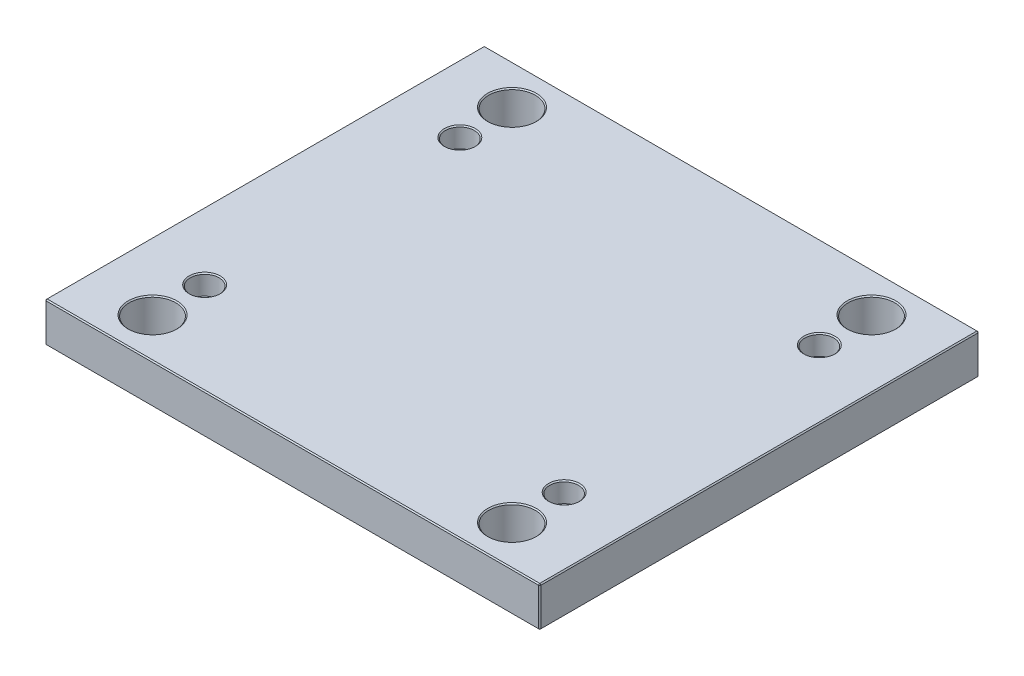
ISO-10303-21;
HEADER;
FILE_DESCRIPTION(('STEP AP214'),'2;1');
FILE_NAME('part.step','',(''),(''),'','','');
FILE_SCHEMA(('AUTOMOTIVE_DESIGN { 1 0 10303 214 1 1 1 1 }'));
ENDSEC;
DATA;
#1=APPLICATION_CONTEXT('core data for automotive mechanical design processes');
#2=APPLICATION_PROTOCOL_DEFINITION('international standard','automotive_design',2000,#1);
#3=PRODUCT_CONTEXT('',#1,'mechanical');
#4=PRODUCT('Part','Part','',(#3));
#5=PRODUCT_RELATED_PRODUCT_CATEGORY('part','',(#4));
#6=PRODUCT_DEFINITION_FORMATION('','',#4);
#7=PRODUCT_DEFINITION_CONTEXT('part definition',#1,'design');
#8=PRODUCT_DEFINITION('design','',#6,#7);
#9=PRODUCT_DEFINITION_SHAPE('','',#8);
#10=(LENGTH_UNIT() NAMED_UNIT(*) SI_UNIT(.MILLI.,.METRE.));
#11=(NAMED_UNIT(*) PLANE_ANGLE_UNIT() SI_UNIT($,.RADIAN.));
#12=(NAMED_UNIT(*) SI_UNIT($,.STERADIAN.) SOLID_ANGLE_UNIT());
#13=UNCERTAINTY_MEASURE_WITH_UNIT(LENGTH_MEASURE(1.E-05),#10,'distance_accuracy_value','');
#14=(GEOMETRIC_REPRESENTATION_CONTEXT(3) GLOBAL_UNCERTAINTY_ASSIGNED_CONTEXT((#13)) GLOBAL_UNIT_ASSIGNED_CONTEXT((#10,
#11,#12)) REPRESENTATION_CONTEXT('',''));
#15=CARTESIAN_POINT('',(0.,0.,0.));
#16=DIRECTION('',(0.,0.,1.));
#17=DIRECTION('',(1.,0.,0.));
#18=AXIS2_PLACEMENT_3D('',#15,#16,#17);
#19=CARTESIAN_POINT('',(-223.,36.,198.));
#20=DIRECTION('',(1.,0.,0.));
#21=DIRECTION('',(0.,0.,-1.));
#22=AXIS2_PLACEMENT_3D('',#19,#20,#21);
#23=PLANE('',#22);
#24=DIRECTION('',(0.,-1.,0.));
#25=VECTOR('',#24,1.);
#26=CARTESIAN_POINT('',(-223.,36.,-197.));
#27=LINE('',#26,#25);
#28=CARTESIAN_POINT('',(-223.,35.,-197.));
#29=VERTEX_POINT('',#28);
#30=CARTESIAN_POINT('',(-223.,1.,-197.));
#31=VERTEX_POINT('',#30);
#32=EDGE_CURVE('E115',#29,#31,#27,.T.);
#33=ORIENTED_EDGE('',*,*,#32,.T.);
#34=DIRECTION('',(0.,0.,1.));
#35=VECTOR('',#34,1.);
#36=CARTESIAN_POINT('',(-223.,1.,198.));
#37=LINE('',#36,#35);
#38=CARTESIAN_POINT('',(-223.,1.,197.));
#39=VERTEX_POINT('',#38);
#40=EDGE_CURVE('E111',#31,#39,#37,.T.);
#41=ORIENTED_EDGE('',*,*,#40,.T.);
#42=DIRECTION('',(0.,1.,0.));
#43=VECTOR('',#42,1.);
#44=CARTESIAN_POINT('',(-223.,36.,197.));
#45=LINE('',#44,#43);
#46=CARTESIAN_POINT('',(-223.,35.,197.));
#47=VERTEX_POINT('',#46);
#48=EDGE_CURVE('E104',#39,#47,#45,.T.);
#49=ORIENTED_EDGE('',*,*,#48,.T.);
#50=DIRECTION('',(0.,0.,-1.));
#51=VECTOR('',#50,1.);
#52=CARTESIAN_POINT('',(-223.,35.,-198.));
#53=LINE('',#52,#51);
#54=EDGE_CURVE('E108',#47,#29,#53,.T.);
#55=ORIENTED_EDGE('',*,*,#54,.T.);
#56=EDGE_LOOP('',(#33,#41,#49,#55));
#57=FACE_BOUND('',#56,.T.);
#58=ADVANCED_FACE('F16',(#57),#23,.F.);
#59=CARTESIAN_POINT('',(223.,36.,198.));
#60=DIRECTION('',(0.,0.,-1.));
#61=DIRECTION('',(-1.,0.,0.));
#62=AXIS2_PLACEMENT_3D('',#59,#60,#61);
#63=PLANE('',#62);
#64=DIRECTION('',(-1.,0.,0.));
#65=VECTOR('',#64,1.);
#66=CARTESIAN_POINT('',(-223.,35.,198.));
#67=LINE('',#66,#65);
#68=CARTESIAN_POINT('',(222.,35.,198.));
#69=VERTEX_POINT('',#68);
#70=CARTESIAN_POINT('',(-222.,35.,198.));
#71=VERTEX_POINT('',#70);
#72=EDGE_CURVE('E170',#69,#71,#67,.T.);
#73=ORIENTED_EDGE('',*,*,#72,.T.);
#74=DIRECTION('',(0.,-1.,0.));
#75=VECTOR('',#74,1.);
#76=CARTESIAN_POINT('',(-222.,36.,198.));
#77=LINE('',#76,#75);
#78=CARTESIAN_POINT('',(-222.,1.00000000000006,198.));
#79=VERTEX_POINT('',#78);
#80=EDGE_CURVE('E123',#71,#79,#77,.T.);
#81=ORIENTED_EDGE('',*,*,#80,.T.);
#82=DIRECTION('',(1.,0.,0.));
#83=VECTOR('',#82,1.);
#84=CARTESIAN_POINT('',(223.,1.00000000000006,198.));
#85=LINE('',#84,#83);
#86=CARTESIAN_POINT('',(222.,1.00000000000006,198.));
#87=VERTEX_POINT('',#86);
#88=EDGE_CURVE('E174',#79,#87,#85,.T.);
#89=ORIENTED_EDGE('',*,*,#88,.T.);
#90=DIRECTION('',(0.,1.,0.));
#91=VECTOR('',#90,1.);
#92=CARTESIAN_POINT('',(222.,36.,198.));
#93=LINE('',#92,#91);
#94=EDGE_CURVE('E172',#87,#69,#93,.T.);
#95=ORIENTED_EDGE('',*,*,#94,.T.);
#96=EDGE_LOOP('',(#73,#81,#89,#95));
#97=FACE_BOUND('',#96,.T.);
#98=ADVANCED_FACE('F413',(#97),#63,.F.);
#99=CARTESIAN_POINT('',(223.,36.,198.));
#100=DIRECTION('',(-1.,0.,0.));
#101=DIRECTION('',(0.,0.,1.));
#102=AXIS2_PLACEMENT_3D('',#99,#100,#101);
#103=PLANE('',#102);
#104=DIRECTION('',(0.,0.,-1.));
#105=VECTOR('',#104,1.);
#106=CARTESIAN_POINT('',(223.,1.00000000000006,198.));
#107=LINE('',#106,#105);
#108=CARTESIAN_POINT('',(223.,1.00000000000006,197.));
#109=VERTEX_POINT('',#108);
#110=CARTESIAN_POINT('',(223.,1.00000000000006,-197.));
#111=VERTEX_POINT('',#110);
#112=EDGE_CURVE('E165',#109,#111,#107,.T.);
#113=ORIENTED_EDGE('',*,*,#112,.T.);
#114=DIRECTION('',(0.,1.,0.));
#115=VECTOR('',#114,1.);
#116=CARTESIAN_POINT('',(223.,36.,-197.));
#117=LINE('',#116,#115);
#118=CARTESIAN_POINT('',(223.,35.,-197.));
#119=VERTEX_POINT('',#118);
#120=EDGE_CURVE('E167',#111,#119,#117,.T.);
#121=ORIENTED_EDGE('',*,*,#120,.T.);
#122=DIRECTION('',(0.,0.,1.));
#123=VECTOR('',#122,1.);
#124=CARTESIAN_POINT('',(223.,35.,198.));
#125=LINE('',#124,#123);
#126=CARTESIAN_POINT('',(223.,35.,197.));
#127=VERTEX_POINT('',#126);
#128=EDGE_CURVE('E161',#119,#127,#125,.T.);
#129=ORIENTED_EDGE('',*,*,#128,.T.);
#130=DIRECTION('',(0.,-1.,0.));
#131=VECTOR('',#130,1.);
#132=CARTESIAN_POINT('',(223.,36.,197.));
#133=LINE('',#132,#131);
#134=EDGE_CURVE('E163',#127,#109,#133,.T.);
#135=ORIENTED_EDGE('',*,*,#134,.T.);
#136=EDGE_LOOP('',(#113,#121,#129,#135));
#137=FACE_BOUND('',#136,.T.);
#138=ADVANCED_FACE('F406',(#137),#103,.F.);
#139=CARTESIAN_POINT('',(223.,36.,-198.));
#140=DIRECTION('',(0.,0.,1.));
#141=DIRECTION('',(1.,0.,0.));
#142=AXIS2_PLACEMENT_3D('',#139,#140,#141);
#143=PLANE('',#142);
#144=DIRECTION('',(0.,-1.,0.));
#145=VECTOR('',#144,1.);
#146=CARTESIAN_POINT('',(222.,36.,-198.));
#147=LINE('',#146,#145);
#148=CARTESIAN_POINT('',(222.,35.,-198.));
#149=VERTEX_POINT('',#148);
#150=CARTESIAN_POINT('',(222.,1.00000000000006,-198.));
#151=VERTEX_POINT('',#150);
#152=EDGE_CURVE('E154',#149,#151,#147,.T.);
#153=ORIENTED_EDGE('',*,*,#152,.T.);
#154=DIRECTION('',(-1.,0.,0.));
#155=VECTOR('',#154,1.);
#156=CARTESIAN_POINT('',(223.,1.00000000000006,-198.));
#157=LINE('',#156,#155);
#158=CARTESIAN_POINT('',(-222.,1.00000000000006,-198.));
#159=VERTEX_POINT('',#158);
#160=EDGE_CURVE('E159',#151,#159,#157,.T.);
#161=ORIENTED_EDGE('',*,*,#160,.T.);
#162=DIRECTION('',(0.,1.,0.));
#163=VECTOR('',#162,1.);
#164=CARTESIAN_POINT('',(-222.,36.,-198.));
#165=LINE('',#164,#163);
#166=CARTESIAN_POINT('',(-222.,35.,-198.));
#167=VERTEX_POINT('',#166);
#168=EDGE_CURVE('E156',#159,#167,#165,.T.);
#169=ORIENTED_EDGE('',*,*,#168,.T.);
#170=DIRECTION('',(1.,0.,0.));
#171=VECTOR('',#170,1.);
#172=CARTESIAN_POINT('',(223.,35.,-198.));
#173=LINE('',#172,#171);
#174=EDGE_CURVE('E152',#167,#149,#173,.T.);
#175=ORIENTED_EDGE('',*,*,#174,.T.);
#176=EDGE_LOOP('',(#153,#161,#169,#175));
#177=FACE_BOUND('',#176,.T.);
#178=ADVANCED_FACE('F431',(#177),#143,.F.);
#179=CARTESIAN_POINT('',(0.,36.,0.));
#180=DIRECTION('',(0.,1.,0.));
#181=DIRECTION('',(0.,0.,1.));
#182=AXIS2_PLACEMENT_3D('',#179,#180,#181);
#183=PLANE('',#182);
#184=CARTESIAN_POINT('',(-162.,36.,162.));
#185=DIRECTION('',(0.,1.,0.));
#186=DIRECTION('',(0.,0.,1.));
#187=AXIS2_PLACEMENT_3D('',#184,#185,#186);
#188=CIRCLE('',#187,22.);
#189=CARTESIAN_POINT('',(-162.,36.,184.));
#190=VERTEX_POINT('',#189);
#191=EDGE_CURVE('E317',#190,#190,#188,.F.);
#192=ORIENTED_EDGE('',*,*,#191,.T.);
#193=EDGE_LOOP('',(#192));
#194=FACE_BOUND('',#193,.T.);
#195=CARTESIAN_POINT('',(162.,36.,162.));
#196=DIRECTION('',(0.,1.,0.));
#197=DIRECTION('',(0.,0.,1.));
#198=AXIS2_PLACEMENT_3D('',#195,#196,#197);
#199=CIRCLE('',#198,22.);
#200=CARTESIAN_POINT('',(162.,36.,184.));
#201=VERTEX_POINT('',#200);
#202=EDGE_CURVE('E314',#201,#201,#199,.F.);
#203=ORIENTED_EDGE('',*,*,#202,.T.);
#204=EDGE_LOOP('',(#203));
#205=FACE_BOUND('',#204,.T.);
#206=CARTESIAN_POINT('',(162.,36.,-162.));
#207=DIRECTION('',(0.,1.,0.));
#208=DIRECTION('',(0.,0.,1.));
#209=AXIS2_PLACEMENT_3D('',#206,#207,#208);
#210=CIRCLE('',#209,22.);
#211=CARTESIAN_POINT('',(162.,36.,-140.));
#212=VERTEX_POINT('',#211);
#213=EDGE_CURVE('E311',#212,#212,#210,.F.);
#214=ORIENTED_EDGE('',*,*,#213,.T.);
#215=EDGE_LOOP('',(#214));
#216=FACE_BOUND('',#215,.T.);
#217=CARTESIAN_POINT('',(-162.,36.,-162.));
#218=DIRECTION('',(0.,1.,0.));
#219=DIRECTION('',(0.,0.,1.));
#220=AXIS2_PLACEMENT_3D('',#217,#218,#219);
#221=CIRCLE('',#220,22.);
#222=CARTESIAN_POINT('',(-162.,36.,-140.));
#223=VERTEX_POINT('',#222);
#224=EDGE_CURVE('E308',#223,#223,#221,.F.);
#225=ORIENTED_EDGE('',*,*,#224,.T.);
#226=EDGE_LOOP('',(#225));
#227=FACE_BOUND('',#226,.T.);
#228=CARTESIAN_POINT('',(-162.,36.,115.));
#229=DIRECTION('',(0.,1.,0.));
#230=DIRECTION('',(0.,0.,1.));
#231=AXIS2_PLACEMENT_3D('',#228,#229,#230);
#232=CIRCLE('',#231,14.);
#233=CARTESIAN_POINT('',(-162.,36.,129.));
#234=VERTEX_POINT('',#233);
#235=EDGE_CURVE('E290',#234,#234,#232,.F.);
#236=ORIENTED_EDGE('',*,*,#235,.T.);
#237=EDGE_LOOP('',(#236));
#238=FACE_BOUND('',#237,.T.);
#239=CARTESIAN_POINT('',(162.,36.,115.));
#240=DIRECTION('',(0.,1.,0.));
#241=DIRECTION('',(0.,0.,1.));
#242=AXIS2_PLACEMENT_3D('',#239,#240,#241);
#243=CIRCLE('',#242,14.);
#244=CARTESIAN_POINT('',(162.,36.,129.));
#245=VERTEX_POINT('',#244);
#246=EDGE_CURVE('E287',#245,#245,#243,.F.);
#247=ORIENTED_EDGE('',*,*,#246,.T.);
#248=EDGE_LOOP('',(#247));
#249=FACE_BOUND('',#248,.T.);
#250=CARTESIAN_POINT('',(162.,36.,-115.));
#251=DIRECTION('',(0.,1.,0.));
#252=DIRECTION('',(0.,0.,1.));
#253=AXIS2_PLACEMENT_3D('',#250,#251,#252);
#254=CIRCLE('',#253,14.);
#255=CARTESIAN_POINT('',(162.,36.,-101.));
#256=VERTEX_POINT('',#255);
#257=EDGE_CURVE('E284',#256,#256,#254,.F.);
#258=ORIENTED_EDGE('',*,*,#257,.T.);
#259=EDGE_LOOP('',(#258));
#260=FACE_BOUND('',#259,.T.);
#261=CARTESIAN_POINT('',(-162.,36.,-115.));
#262=DIRECTION('',(0.,1.,0.));
#263=DIRECTION('',(0.,0.,1.));
#264=AXIS2_PLACEMENT_3D('',#261,#262,#263);
#265=CIRCLE('',#264,14.);
#266=CARTESIAN_POINT('',(-162.,36.,-101.));
#267=VERTEX_POINT('',#266);
#268=EDGE_CURVE('E281',#267,#267,#265,.F.);
#269=ORIENTED_EDGE('',*,*,#268,.T.);
#270=EDGE_LOOP('',(#269));
#271=FACE_BOUND('',#270,.T.);
#272=DIRECTION('',(0.,0.,-1.));
#273=VECTOR('',#272,1.);
#274=CARTESIAN_POINT('',(222.,36.,-198.));
#275=LINE('',#274,#273);
#276=CARTESIAN_POINT('',(222.,36.,197.));
#277=VERTEX_POINT('',#276);
#278=CARTESIAN_POINT('',(222.,36.,-197.));
#279=VERTEX_POINT('',#278);
#280=EDGE_CURVE('E31',#277,#279,#275,.T.);
#281=ORIENTED_EDGE('',*,*,#280,.T.);
#282=DIRECTION('',(-1.,0.,0.));
#283=VECTOR('',#282,1.);
#284=CARTESIAN_POINT('',(-223.,36.,-197.));
#285=LINE('',#284,#283);
#286=CARTESIAN_POINT('',(-222.,36.,-197.));
#287=VERTEX_POINT('',#286);
#288=EDGE_CURVE('E190',#279,#287,#285,.T.);
#289=ORIENTED_EDGE('',*,*,#288,.T.);
#290=DIRECTION('',(0.,0.,1.));
#291=VECTOR('',#290,1.);
#292=CARTESIAN_POINT('',(-222.,36.,198.));
#293=LINE('',#292,#291);
#294=CARTESIAN_POINT('',(-222.,36.,197.));
#295=VERTEX_POINT('',#294);
#296=EDGE_CURVE('E186',#287,#295,#293,.T.);
#297=ORIENTED_EDGE('',*,*,#296,.T.);
#298=DIRECTION('',(1.,0.,0.));
#299=VECTOR('',#298,1.);
#300=CARTESIAN_POINT('',(223.,36.,197.));
#301=LINE('',#300,#299);
#302=EDGE_CURVE('E36',#295,#277,#301,.T.);
#303=ORIENTED_EDGE('',*,*,#302,.T.);
#304=EDGE_LOOP('',(#281,#289,#297,#303));
#305=FACE_BOUND('',#304,.T.);
#306=ADVANCED_FACE('F357',(#194,#205,#216,#227,#238,#249,#260,#271,#305),#183,.T.);
#307=CARTESIAN_POINT('',(0.,0.,0.));
#308=DIRECTION('',(0.,1.,0.));
#309=DIRECTION('',(0.,0.,1.));
#310=AXIS2_PLACEMENT_3D('',#307,#308,#309);
#311=PLANE('',#310);
#312=CARTESIAN_POINT('',(-162.,0.,162.));
#313=DIRECTION('',(0.,1.,0.));
#314=DIRECTION('',(0.,0.,1.));
#315=AXIS2_PLACEMENT_3D('',#312,#313,#314);
#316=CIRCLE('',#315,22.);
#317=CARTESIAN_POINT('',(-162.,0.,184.));
#318=VERTEX_POINT('',#317);
#319=EDGE_CURVE('E329',#318,#318,#316,.T.);
#320=ORIENTED_EDGE('',*,*,#319,.T.);
#321=EDGE_LOOP('',(#320));
#322=FACE_BOUND('',#321,.T.);
#323=CARTESIAN_POINT('',(162.,0.,162.));
#324=DIRECTION('',(0.,1.,0.));
#325=DIRECTION('',(0.,0.,1.));
#326=AXIS2_PLACEMENT_3D('',#323,#324,#325);
#327=CIRCLE('',#326,22.);
#328=CARTESIAN_POINT('',(162.,0.,184.));
#329=VERTEX_POINT('',#328);
#330=EDGE_CURVE('E326',#329,#329,#327,.T.);
#331=ORIENTED_EDGE('',*,*,#330,.T.);
#332=EDGE_LOOP('',(#331));
#333=FACE_BOUND('',#332,.T.);
#334=CARTESIAN_POINT('',(162.,0.,-162.));
#335=DIRECTION('',(0.,1.,0.));
#336=DIRECTION('',(0.,0.,1.));
#337=AXIS2_PLACEMENT_3D('',#334,#335,#336);
#338=CIRCLE('',#337,22.);
#339=CARTESIAN_POINT('',(162.,0.,-140.));
#340=VERTEX_POINT('',#339);
#341=EDGE_CURVE('E323',#340,#340,#338,.T.);
#342=ORIENTED_EDGE('',*,*,#341,.T.);
#343=EDGE_LOOP('',(#342));
#344=FACE_BOUND('',#343,.T.);
#345=CARTESIAN_POINT('',(-162.,0.,-162.));
#346=DIRECTION('',(0.,1.,0.));
#347=DIRECTION('',(0.,0.,1.));
#348=AXIS2_PLACEMENT_3D('',#345,#346,#347);
#349=CIRCLE('',#348,22.);
#350=CARTESIAN_POINT('',(-162.,0.,-140.));
#351=VERTEX_POINT('',#350);
#352=EDGE_CURVE('E320',#351,#351,#349,.T.);
#353=ORIENTED_EDGE('',*,*,#352,.T.);
#354=EDGE_LOOP('',(#353));
#355=FACE_BOUND('',#354,.T.);
#356=CARTESIAN_POINT('',(162.,0.,-115.));
#357=DIRECTION('',(0.,1.,0.));
#358=DIRECTION('',(0.,0.,1.));
#359=AXIS2_PLACEMENT_3D('',#356,#357,#358);
#360=CIRCLE('',#359,10.);
#361=CARTESIAN_POINT('',(162.,0.,-105.));
#362=VERTEX_POINT('',#361);
#363=EDGE_CURVE('E263',#362,#362,#360,.T.);
#364=ORIENTED_EDGE('',*,*,#363,.T.);
#365=EDGE_LOOP('',(#364));
#366=FACE_BOUND('',#365,.T.);
#367=CARTESIAN_POINT('',(162.,0.,115.));
#368=DIRECTION('',(0.,1.,0.));
#369=DIRECTION('',(0.,0.,1.));
#370=AXIS2_PLACEMENT_3D('',#367,#368,#369);
#371=CIRCLE('',#370,10.);
#372=CARTESIAN_POINT('',(162.,0.,125.));
#373=VERTEX_POINT('',#372);
#374=EDGE_CURVE('E260',#373,#373,#371,.T.);
#375=ORIENTED_EDGE('',*,*,#374,.T.);
#376=EDGE_LOOP('',(#375));
#377=FACE_BOUND('',#376,.T.);
#378=CARTESIAN_POINT('',(-162.,0.,115.));
#379=DIRECTION('',(0.,1.,0.));
#380=DIRECTION('',(0.,0.,1.));
#381=AXIS2_PLACEMENT_3D('',#378,#379,#380);
#382=CIRCLE('',#381,10.);
#383=CARTESIAN_POINT('',(-162.,0.,125.));
#384=VERTEX_POINT('',#383);
#385=EDGE_CURVE('E257',#384,#384,#382,.T.);
#386=ORIENTED_EDGE('',*,*,#385,.T.);
#387=EDGE_LOOP('',(#386));
#388=FACE_BOUND('',#387,.T.);
#389=CARTESIAN_POINT('',(-162.,0.,-115.));
#390=DIRECTION('',(0.,1.,0.));
#391=DIRECTION('',(0.,0.,1.));
#392=AXIS2_PLACEMENT_3D('',#389,#390,#391);
#393=CIRCLE('',#392,10.);
#394=CARTESIAN_POINT('',(-162.,0.,-105.));
#395=VERTEX_POINT('',#394);
#396=EDGE_CURVE('E192',#395,#395,#393,.T.);
#397=ORIENTED_EDGE('',*,*,#396,.T.);
#398=EDGE_LOOP('',(#397));
#399=FACE_BOUND('',#398,.T.);
#400=DIRECTION('',(0.,0.,1.));
#401=VECTOR('',#400,1.);
#402=CARTESIAN_POINT('',(222.,0.,0.));
#403=LINE('',#402,#401);
#404=CARTESIAN_POINT('',(222.,0.,-197.));
#405=VERTEX_POINT('',#404);
#406=CARTESIAN_POINT('',(222.,0.,197.));
#407=VERTEX_POINT('',#406);
#408=EDGE_CURVE('E177',#405,#407,#403,.T.);
#409=ORIENTED_EDGE('',*,*,#408,.T.);
#410=DIRECTION('',(-1.,0.,0.));
#411=VECTOR('',#410,1.);
#412=CARTESIAN_POINT('',(0.,0.,197.));
#413=LINE('',#412,#411);
#414=CARTESIAN_POINT('',(-222.,0.,197.));
#415=VERTEX_POINT('',#414);
#416=EDGE_CURVE('E183',#407,#415,#413,.T.);
#417=ORIENTED_EDGE('',*,*,#416,.T.);
#418=DIRECTION('',(0.,0.,-1.));
#419=VECTOR('',#418,1.);
#420=CARTESIAN_POINT('',(-222.,0.,0.));
#421=LINE('',#420,#419);
#422=CARTESIAN_POINT('',(-222.,0.,-197.));
#423=VERTEX_POINT('',#422);
#424=EDGE_CURVE('E181',#415,#423,#421,.T.);
#425=ORIENTED_EDGE('',*,*,#424,.T.);
#426=DIRECTION('',(1.,0.,0.));
#427=VECTOR('',#426,1.);
#428=CARTESIAN_POINT('',(0.,0.,-197.));
#429=LINE('',#428,#427);
#430=EDGE_CURVE('E179',#423,#405,#429,.T.);
#431=ORIENTED_EDGE('',*,*,#430,.T.);
#432=EDGE_LOOP('',(#409,#417,#425,#431));
#433=FACE_BOUND('',#432,.T.);
#434=ADVANCED_FACE('F353',(#322,#333,#344,#355,#366,#377,#388,#399,#433),#311,.F.);
#435=CARTESIAN_POINT('',(223.,36.,197.));
#436=DIRECTION('',(-0.707106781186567,0.,-0.707106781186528));
#437=DIRECTION('',(0.,-1.,0.));
#438=AXIS2_PLACEMENT_3D('',#435,#436,#437);
#439=PLANE('',#438);
#440=DIRECTION('',(-0.707106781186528,0.,0.707106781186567));
#441=VECTOR('',#440,1.);
#442=CARTESIAN_POINT('',(222.,35.,198.));
#443=LINE('',#442,#441);
#444=EDGE_CURVE('E141',#69,#127,#443,.F.);
#445=ORIENTED_EDGE('',*,*,#444,.F.);
#446=ORIENTED_EDGE('',*,*,#94,.F.);
#447=DIRECTION('',(0.707106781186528,0.,-0.707106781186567));
#448=VECTOR('',#447,1.);
#449=CARTESIAN_POINT('',(222.,1.00000000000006,198.));
#450=LINE('',#449,#448);
#451=EDGE_CURVE('E144',#109,#87,#450,.F.);
#452=ORIENTED_EDGE('',*,*,#451,.F.);
#453=ORIENTED_EDGE('',*,*,#134,.F.);
#454=EDGE_LOOP('',(#445,#446,#452,#453));
#455=FACE_BOUND('',#454,.T.);
#456=ADVANCED_FACE('F356',(#455),#439,.F.);
#457=CARTESIAN_POINT('',(222.,35.,198.));
#458=DIRECTION('',(0.577350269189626,0.577350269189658,0.577350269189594));
#459=DIRECTION('',(-0.707106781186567,0.707106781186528,0.));
#460=AXIS2_PLACEMENT_3D('',#457,#458,#459);
#461=PLANE('',#460);
#462=DIRECTION('',(0.,-0.707106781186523,0.707106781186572));
#463=VECTOR('',#462,1.);
#464=CARTESIAN_POINT('',(222.,35.,198.));
#465=LINE('',#464,#463);
#466=EDGE_CURVE('E235',#69,#277,#465,.F.);
#467=ORIENTED_EDGE('',*,*,#466,.F.);
#468=ORIENTED_EDGE('',*,*,#444,.T.);
#469=DIRECTION('',(-0.707106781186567,0.707106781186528,0.));
#470=VECTOR('',#469,1.);
#471=CARTESIAN_POINT('',(222.5,35.5,197.));
#472=LINE('',#471,#470);
#473=EDGE_CURVE('E237',#277,#127,#472,.F.);
#474=ORIENTED_EDGE('',*,*,#473,.F.);
#475=EDGE_LOOP('',(#467,#468,#474));
#476=FACE_BOUND('',#475,.T.);
#477=ADVANCED_FACE('F419',(#476),#461,.T.);
#478=CARTESIAN_POINT('',(222.,1.00000000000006,198.));
#479=DIRECTION('',(0.577350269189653,-0.577350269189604,0.57735026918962));
#480=DIRECTION('',(0.707106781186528,0.,-0.707106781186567));
#481=AXIS2_PLACEMENT_3D('',#478,#479,#480);
#482=PLANE('',#481);
#483=DIRECTION('',(-0.707106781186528,-0.707106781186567,0.));
#484=VECTOR('',#483,1.);
#485=CARTESIAN_POINT('',(222.5,0.500000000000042,197.));
#486=LINE('',#485,#484);
#487=EDGE_CURVE('E229',#109,#407,#486,.T.);
#488=ORIENTED_EDGE('',*,*,#487,.F.);
#489=ORIENTED_EDGE('',*,*,#451,.T.);
#490=DIRECTION('',(0.,0.707106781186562,0.707106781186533));
#491=VECTOR('',#490,1.);
#492=CARTESIAN_POINT('',(222.,1.00000000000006,198.));
#493=LINE('',#492,#491);
#494=EDGE_CURVE('E232',#407,#87,#493,.T.);
#495=ORIENTED_EDGE('',*,*,#494,.F.);
#496=EDGE_LOOP('',(#488,#489,#495));
#497=FACE_BOUND('',#496,.T.);
#498=ADVANCED_FACE('F378',(#497),#482,.T.);
#499=CARTESIAN_POINT('',(222.,36.,0.));
#500=DIRECTION('',(0.707106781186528,0.707106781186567,0.));
#501=DIRECTION('',(0.,0.,1.));
#502=AXIS2_PLACEMENT_3D('',#499,#500,#501);
#503=PLANE('',#502);
#504=ORIENTED_EDGE('',*,*,#473,.T.);
#505=ORIENTED_EDGE('',*,*,#128,.F.);
#506=DIRECTION('',(0.707106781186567,-0.707106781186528,0.));
#507=VECTOR('',#506,1.);
#508=CARTESIAN_POINT('',(223.,35.,-197.));
#509=LINE('',#508,#507);
#510=EDGE_CURVE('E224',#279,#119,#509,.T.);
#511=ORIENTED_EDGE('',*,*,#510,.F.);
#512=ORIENTED_EDGE('',*,*,#280,.F.);
#513=EDGE_LOOP('',(#504,#505,#511,#512));
#514=FACE_BOUND('',#513,.T.);
#515=ADVANCED_FACE('F421',(#514),#503,.T.);
#516=CARTESIAN_POINT('',(0.,36.,197.));
#517=DIRECTION('',(0.,0.707106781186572,0.707106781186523));
#518=DIRECTION('',(-1.,0.,0.));
#519=AXIS2_PLACEMENT_3D('',#516,#517,#518);
#520=PLANE('',#519);
#521=ORIENTED_EDGE('',*,*,#466,.T.);
#522=ORIENTED_EDGE('',*,*,#302,.F.);
#523=DIRECTION('',(0.,0.707106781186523,-0.707106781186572));
#524=VECTOR('',#523,1.);
#525=CARTESIAN_POINT('',(-222.,35.5,197.5));
#526=LINE('',#525,#524);
#527=EDGE_CURVE('E127',#71,#295,#526,.T.);
#528=ORIENTED_EDGE('',*,*,#527,.F.);
#529=ORIENTED_EDGE('',*,*,#72,.F.);
#530=EDGE_LOOP('',(#521,#522,#528,#529));
#531=FACE_BOUND('',#530,.T.);
#532=ADVANCED_FACE('F416',(#531),#520,.T.);
#533=CARTESIAN_POINT('',(-222.,36.,198.));
#534=DIRECTION('',(0.707106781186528,0.,-0.707106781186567));
#535=DIRECTION('',(0.,-1.,0.));
#536=AXIS2_PLACEMENT_3D('',#533,#534,#535);
#537=PLANE('',#536);
#538=DIRECTION('',(0.707106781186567,0.,0.707106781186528));
#539=VECTOR('',#538,1.);
#540=CARTESIAN_POINT('',(-222.,1.00000000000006,198.));
#541=LINE('',#540,#539);
#542=EDGE_CURVE('E128',#79,#39,#541,.F.);
#543=ORIENTED_EDGE('',*,*,#542,.F.);
#544=ORIENTED_EDGE('',*,*,#80,.F.);
#545=DIRECTION('',(-0.707106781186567,0.,-0.707106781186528));
#546=VECTOR('',#545,1.);
#547=CARTESIAN_POINT('',(-223.,35.,197.));
#548=LINE('',#547,#546);
#549=EDGE_CURVE('E119',#47,#71,#548,.F.);
#550=ORIENTED_EDGE('',*,*,#549,.F.);
#551=ORIENTED_EDGE('',*,*,#48,.F.);
#552=EDGE_LOOP('',(#543,#544,#550,#551));
#553=FACE_BOUND('',#552,.T.);
#554=ADVANCED_FACE('F121',(#553),#537,.F.);
#555=CARTESIAN_POINT('',(223.,1.00000000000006,198.));
#556=DIRECTION('',(0.,0.707106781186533,-0.707106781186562));
#557=DIRECTION('',(1.,0.,0.));
#558=AXIS2_PLACEMENT_3D('',#555,#556,#557);
#559=PLANE('',#558);
#560=ORIENTED_EDGE('',*,*,#494,.T.);
#561=ORIENTED_EDGE('',*,*,#88,.F.);
#562=DIRECTION('',(0.,-0.707106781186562,-0.707106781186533));
#563=VECTOR('',#562,1.);
#564=CARTESIAN_POINT('',(-222.,1.00000000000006,198.));
#565=LINE('',#564,#563);
#566=EDGE_CURVE('E220',#415,#79,#565,.F.);
#567=ORIENTED_EDGE('',*,*,#566,.F.);
#568=ORIENTED_EDGE('',*,*,#416,.F.);
#569=EDGE_LOOP('',(#560,#561,#567,#568));
#570=FACE_BOUND('',#569,.T.);
#571=ADVANCED_FACE('F383',(#570),#559,.F.);
#572=CARTESIAN_POINT('',(223.,1.00000000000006,198.));
#573=DIRECTION('',(-0.707106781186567,0.707106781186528,0.));
#574=DIRECTION('',(0.,0.,-1.));
#575=AXIS2_PLACEMENT_3D('',#572,#573,#574);
#576=PLANE('',#575);
#577=ORIENTED_EDGE('',*,*,#487,.T.);
#578=ORIENTED_EDGE('',*,*,#408,.F.);
#579=DIRECTION('',(0.707106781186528,0.707106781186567,0.));
#580=VECTOR('',#579,1.);
#581=CARTESIAN_POINT('',(222.5,0.500000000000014,-197.));
#582=LINE('',#581,#580);
#583=EDGE_CURVE('E217',#111,#405,#582,.F.);
#584=ORIENTED_EDGE('',*,*,#583,.F.);
#585=ORIENTED_EDGE('',*,*,#112,.F.);
#586=EDGE_LOOP('',(#577,#578,#584,#585));
#587=FACE_BOUND('',#586,.T.);
#588=ADVANCED_FACE('F376',(#587),#576,.F.);
#589=CARTESIAN_POINT('',(222.,36.,-198.));
#590=DIRECTION('',(-0.707106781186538,0.,0.707106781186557));
#591=DIRECTION('',(0.,-1.,0.));
#592=AXIS2_PLACEMENT_3D('',#589,#590,#591);
#593=PLANE('',#592);
#594=DIRECTION('',(0.707106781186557,0.,0.707106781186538));
#595=VECTOR('',#594,1.);
#596=CARTESIAN_POINT('',(223.,35.,-197.));
#597=LINE('',#596,#595);
#598=EDGE_CURVE('E226',#119,#149,#597,.F.);
#599=ORIENTED_EDGE('',*,*,#598,.F.);
#600=ORIENTED_EDGE('',*,*,#120,.F.);
#601=DIRECTION('',(-0.707106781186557,0.,-0.707106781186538));
#602=VECTOR('',#601,1.);
#603=CARTESIAN_POINT('',(222.,1.00000000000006,-198.));
#604=LINE('',#603,#602);
#605=EDGE_CURVE('E214',#151,#111,#604,.F.);
#606=ORIENTED_EDGE('',*,*,#605,.F.);
#607=ORIENTED_EDGE('',*,*,#152,.F.);
#608=EDGE_LOOP('',(#599,#600,#606,#607));
#609=FACE_BOUND('',#608,.T.);
#610=ADVANCED_FACE('F403',(#609),#593,.F.);
#611=CARTESIAN_POINT('',(223.,35.,-197.));
#612=DIRECTION('',(0.577350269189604,0.577350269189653,-0.57735026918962));
#613=DIRECTION('',(0.,0.707106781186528,0.707106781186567));
#614=AXIS2_PLACEMENT_3D('',#611,#612,#613);
#615=PLANE('',#614);
#616=ORIENTED_EDGE('',*,*,#510,.T.);
#617=ORIENTED_EDGE('',*,*,#598,.T.);
#618=DIRECTION('',(0.,0.707106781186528,0.707106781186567));
#619=VECTOR('',#618,1.);
#620=CARTESIAN_POINT('',(222.,35.5,-197.5));
#621=LINE('',#620,#619);
#622=EDGE_CURVE('E135',#279,#149,#621,.F.);
#623=ORIENTED_EDGE('',*,*,#622,.F.);
#624=EDGE_LOOP('',(#616,#617,#623));
#625=FACE_BOUND('',#624,.T.);
#626=ADVANCED_FACE('F425',(#625),#615,.T.);
#627=CARTESIAN_POINT('',(-223.,35.,197.));
#628=DIRECTION('',(-0.577350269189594,0.577350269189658,0.577350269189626));
#629=DIRECTION('',(0.,-0.707106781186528,0.707106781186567));
#630=AXIS2_PLACEMENT_3D('',#627,#628,#629);
#631=PLANE('',#630);
#632=ORIENTED_EDGE('',*,*,#549,.T.);
#633=ORIENTED_EDGE('',*,*,#527,.T.);
#634=DIRECTION('',(-0.707106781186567,-0.707106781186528,0.));
#635=VECTOR('',#634,1.);
#636=CARTESIAN_POINT('',(-223.,35.,197.));
#637=LINE('',#636,#635);
#638=EDGE_CURVE('E131',#47,#295,#637,.F.);
#639=ORIENTED_EDGE('',*,*,#638,.F.);
#640=EDGE_LOOP('',(#632,#633,#639));
#641=FACE_BOUND('',#640,.T.);
#642=ADVANCED_FACE('F132',(#641),#631,.T.);
#643=CARTESIAN_POINT('',(-222.,1.00000000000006,198.));
#644=DIRECTION('',(-0.577350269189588,-0.577350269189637,0.577350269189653));
#645=DIRECTION('',(0.,-0.707106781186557,-0.707106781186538));
#646=AXIS2_PLACEMENT_3D('',#643,#644,#645);
#647=PLANE('',#646);
#648=ORIENTED_EDGE('',*,*,#566,.T.);
#649=ORIENTED_EDGE('',*,*,#542,.T.);
#650=DIRECTION('',(-0.707106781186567,0.707106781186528,0.));
#651=VECTOR('',#650,1.);
#652=CARTESIAN_POINT('',(-222.5,0.500000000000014,197.));
#653=LINE('',#652,#651);
#654=EDGE_CURVE('E136',#415,#39,#653,.T.);
#655=ORIENTED_EDGE('',*,*,#654,.F.);
#656=EDGE_LOOP('',(#648,#649,#655));
#657=FACE_BOUND('',#656,.T.);
#658=ADVANCED_FACE('F386',(#657),#647,.T.);
#659=CARTESIAN_POINT('',(222.,1.00000000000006,-198.));
#660=DIRECTION('',(0.577350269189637,-0.577350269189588,-0.577350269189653));
#661=DIRECTION('',(-0.707106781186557,0.,-0.707106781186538));
#662=AXIS2_PLACEMENT_3D('',#659,#660,#661);
#663=PLANE('',#662);
#664=ORIENTED_EDGE('',*,*,#605,.T.);
#665=ORIENTED_EDGE('',*,*,#583,.T.);
#666=DIRECTION('',(0.,-0.707106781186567,0.707106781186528));
#667=VECTOR('',#666,1.);
#668=CARTESIAN_POINT('',(222.,1.00000000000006,-198.));
#669=LINE('',#668,#667);
#670=EDGE_CURVE('E207',#151,#405,#669,.T.);
#671=ORIENTED_EDGE('',*,*,#670,.F.);
#672=EDGE_LOOP('',(#664,#665,#671));
#673=FACE_BOUND('',#672,.T.);
#674=ADVANCED_FACE('F397',(#673),#663,.T.);
#675=CARTESIAN_POINT('',(0.,36.,-197.));
#676=DIRECTION('',(0.,0.707106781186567,-0.707106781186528));
#677=DIRECTION('',(1.,0.,0.));
#678=AXIS2_PLACEMENT_3D('',#675,#676,#677);
#679=PLANE('',#678);
#680=ORIENTED_EDGE('',*,*,#622,.T.);
#681=ORIENTED_EDGE('',*,*,#174,.F.);
#682=DIRECTION('',(0.,-0.707106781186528,-0.707106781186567));
#683=VECTOR('',#682,1.);
#684=CARTESIAN_POINT('',(-222.,35.,-198.));
#685=LINE('',#684,#683);
#686=EDGE_CURVE('E204',#287,#167,#685,.T.);
#687=ORIENTED_EDGE('',*,*,#686,.F.);
#688=ORIENTED_EDGE('',*,*,#288,.F.);
#689=EDGE_LOOP('',(#680,#681,#687,#688));
#690=FACE_BOUND('',#689,.T.);
#691=ADVANCED_FACE('F429',(#690),#679,.T.);
#692=CARTESIAN_POINT('',(-222.,36.,0.));
#693=DIRECTION('',(-0.707106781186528,0.707106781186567,0.));
#694=DIRECTION('',(0.,0.,-1.));
#695=AXIS2_PLACEMENT_3D('',#692,#693,#694);
#696=PLANE('',#695);
#697=ORIENTED_EDGE('',*,*,#638,.T.);
#698=ORIENTED_EDGE('',*,*,#296,.F.);
#699=DIRECTION('',(0.707106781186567,0.707106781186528,0.));
#700=VECTOR('',#699,1.);
#701=CARTESIAN_POINT('',(-222.5,35.5,-197.));
#702=LINE('',#701,#700);
#703=EDGE_CURVE('E139',#29,#287,#702,.T.);
#704=ORIENTED_EDGE('',*,*,#703,.F.);
#705=ORIENTED_EDGE('',*,*,#54,.F.);
#706=EDGE_LOOP('',(#697,#698,#704,#705));
#707=FACE_BOUND('',#706,.T.);
#708=ADVANCED_FACE('F138',(#707),#696,.T.);
#709=CARTESIAN_POINT('',(-223.,1.,198.));
#710=DIRECTION('',(0.707106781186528,0.707106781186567,0.));
#711=DIRECTION('',(0.,0.,1.));
#712=AXIS2_PLACEMENT_3D('',#709,#710,#711);
#713=PLANE('',#712);
#714=ORIENTED_EDGE('',*,*,#654,.T.);
#715=ORIENTED_EDGE('',*,*,#40,.F.);
#716=DIRECTION('',(0.707106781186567,-0.707106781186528,0.));
#717=VECTOR('',#716,1.);
#718=CARTESIAN_POINT('',(-223.,1.,-197.));
#719=LINE('',#718,#717);
#720=EDGE_CURVE('E200',#423,#31,#719,.F.);
#721=ORIENTED_EDGE('',*,*,#720,.F.);
#722=ORIENTED_EDGE('',*,*,#424,.F.);
#723=EDGE_LOOP('',(#714,#715,#721,#722));
#724=FACE_BOUND('',#723,.T.);
#725=ADVANCED_FACE('F388',(#724),#713,.F.);
#726=CARTESIAN_POINT('',(223.,1.00000000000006,-198.));
#727=DIRECTION('',(0.,0.707106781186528,0.707106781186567));
#728=DIRECTION('',(-1.,0.,0.));
#729=AXIS2_PLACEMENT_3D('',#726,#727,#728);
#730=PLANE('',#729);
#731=ORIENTED_EDGE('',*,*,#670,.T.);
#732=ORIENTED_EDGE('',*,*,#430,.F.);
#733=DIRECTION('',(0.,0.707106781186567,-0.707106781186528));
#734=VECTOR('',#733,1.);
#735=CARTESIAN_POINT('',(-222.,0.500000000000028,-197.5));
#736=LINE('',#735,#734);
#737=EDGE_CURVE('E197',#159,#423,#736,.F.);
#738=ORIENTED_EDGE('',*,*,#737,.F.);
#739=ORIENTED_EDGE('',*,*,#160,.F.);
#740=EDGE_LOOP('',(#731,#732,#738,#739));
#741=FACE_BOUND('',#740,.T.);
#742=ADVANCED_FACE('F392',(#741),#730,.F.);
#743=CARTESIAN_POINT('',(-222.,35.,-198.));
#744=DIRECTION('',(-0.577350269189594,0.577350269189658,-0.577350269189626));
#745=DIRECTION('',(0.,0.707106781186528,0.707106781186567));
#746=AXIS2_PLACEMENT_3D('',#743,#744,#745);
#747=PLANE('',#746);
#748=ORIENTED_EDGE('',*,*,#703,.T.);
#749=ORIENTED_EDGE('',*,*,#686,.T.);
#750=DIRECTION('',(0.707106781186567,0.,-0.707106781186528));
#751=VECTOR('',#750,1.);
#752=CARTESIAN_POINT('',(-222.,35.,-198.));
#753=LINE('',#752,#751);
#754=EDGE_CURVE('E195',#29,#167,#753,.T.);
#755=ORIENTED_EDGE('',*,*,#754,.F.);
#756=EDGE_LOOP('',(#748,#749,#755));
#757=FACE_BOUND('',#756,.T.);
#758=ADVANCED_FACE('F460',(#757),#747,.T.);
#759=CARTESIAN_POINT('',(-223.,1.,-197.));
#760=DIRECTION('',(-0.577350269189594,-0.577350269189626,-0.577350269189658));
#761=DIRECTION('',(0.,0.707106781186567,-0.707106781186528));
#762=AXIS2_PLACEMENT_3D('',#759,#760,#761);
#763=PLANE('',#762);
#764=ORIENTED_EDGE('',*,*,#737,.T.);
#765=ORIENTED_EDGE('',*,*,#720,.T.);
#766=DIRECTION('',(-0.707106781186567,0.,0.707106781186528));
#767=VECTOR('',#766,1.);
#768=CARTESIAN_POINT('',(-223.,1.,-197.));
#769=LINE('',#768,#767);
#770=EDGE_CURVE('E193',#159,#31,#769,.T.);
#771=ORIENTED_EDGE('',*,*,#770,.F.);
#772=EDGE_LOOP('',(#764,#765,#771));
#773=FACE_BOUND('',#772,.T.);
#774=ADVANCED_FACE('F456',(#773),#763,.T.);
#775=CARTESIAN_POINT('',(-223.,36.,-197.));
#776=DIRECTION('',(0.707106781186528,0.,0.707106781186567));
#777=DIRECTION('',(0.,-1.,0.));
#778=AXIS2_PLACEMENT_3D('',#775,#776,#777);
#779=PLANE('',#778);
#780=ORIENTED_EDGE('',*,*,#754,.T.);
#781=ORIENTED_EDGE('',*,*,#168,.F.);
#782=ORIENTED_EDGE('',*,*,#770,.T.);
#783=ORIENTED_EDGE('',*,*,#32,.F.);
#784=EDGE_LOOP('',(#780,#781,#782,#783));
#785=FACE_BOUND('',#784,.T.);
#786=ADVANCED_FACE('F452',(#785),#779,.F.);
#787=CARTESIAN_POINT('',(-162.,18.,-115.));
#788=DIRECTION('',(0.,1.,0.));
#789=DIRECTION('',(0.,0.,1.));
#790=AXIS2_PLACEMENT_3D('',#787,#788,#789);
#791=CYLINDRICAL_SURFACE('',#790,13.);
#792=CARTESIAN_POINT('',(-162.,35.,-115.));
#793=DIRECTION('',(0.,1.,0.));
#794=DIRECTION('',(0.,0.,1.));
#795=AXIS2_PLACEMENT_3D('',#792,#793,#794);
#796=CIRCLE('',#795,13.);
#797=CARTESIAN_POINT('',(-162.,35.,-102.));
#798=VERTEX_POINT('',#797);
#799=EDGE_CURVE('E299',#798,#798,#796,.T.);
#800=ORIENTED_EDGE('',*,*,#799,.T.);
#801=EDGE_LOOP('',(#800));
#802=FACE_BOUND('',#801,.T.);
#803=CARTESIAN_POINT('',(-162.,18.,-115.));
#804=DIRECTION('',(0.,1.,0.));
#805=DIRECTION('',(0.,0.,1.));
#806=AXIS2_PLACEMENT_3D('',#803,#804,#805);
#807=CIRCLE('',#806,13.);
#808=CARTESIAN_POINT('',(-162.,18.,-102.));
#809=VERTEX_POINT('',#808);
#810=EDGE_CURVE('E147',#809,#809,#807,.T.);
#811=ORIENTED_EDGE('',*,*,#810,.F.);
#812=EDGE_LOOP('',(#811));
#813=FACE_BOUND('',#812,.T.);
#814=ADVANCED_FACE('F455',(#802,#813),#791,.F.);
#815=CARTESIAN_POINT('',(-162.,18.,-115.));
#816=DIRECTION('',(0.,1.,0.));
#817=DIRECTION('',(0.,0.,1.));
#818=AXIS2_PLACEMENT_3D('',#815,#816,#817);
#819=PLANE('',#818);
#820=CARTESIAN_POINT('',(-162.,18.,-115.));
#821=DIRECTION('',(0.,1.,0.));
#822=DIRECTION('',(0.,0.,1.));
#823=AXIS2_PLACEMENT_3D('',#820,#821,#822);
#824=CIRCLE('',#823,9.);
#825=CARTESIAN_POINT('',(-162.,18.,-106.));
#826=VERTEX_POINT('',#825);
#827=EDGE_CURVE('E251',#826,#826,#824,.T.);
#828=ORIENTED_EDGE('',*,*,#827,.F.);
#829=EDGE_LOOP('',(#828));
#830=FACE_BOUND('',#829,.T.);
#831=ORIENTED_EDGE('',*,*,#810,.T.);
#832=EDGE_LOOP('',(#831));
#833=FACE_BOUND('',#832,.T.);
#834=ADVANCED_FACE('F602',(#830,#833),#819,.T.);
#835=CARTESIAN_POINT('',(162.,18.,-115.));
#836=DIRECTION('',(0.,1.,0.));
#837=DIRECTION('',(0.,0.,1.));
#838=AXIS2_PLACEMENT_3D('',#835,#836,#837);
#839=CYLINDRICAL_SURFACE('',#838,13.);
#840=CARTESIAN_POINT('',(162.,35.,-115.));
#841=DIRECTION('',(0.,1.,0.));
#842=DIRECTION('',(0.,0.,1.));
#843=AXIS2_PLACEMENT_3D('',#840,#841,#842);
#844=CIRCLE('',#843,13.);
#845=CARTESIAN_POINT('',(162.,35.,-102.));
#846=VERTEX_POINT('',#845);
#847=EDGE_CURVE('E296',#846,#846,#844,.T.);
#848=ORIENTED_EDGE('',*,*,#847,.T.);
#849=EDGE_LOOP('',(#848));
#850=FACE_BOUND('',#849,.T.);
#851=CARTESIAN_POINT('',(162.,18.,-115.));
#852=DIRECTION('',(0.,1.,0.));
#853=DIRECTION('',(0.,0.,1.));
#854=AXIS2_PLACEMENT_3D('',#851,#852,#853);
#855=CIRCLE('',#854,13.);
#856=CARTESIAN_POINT('',(162.,18.,-102.));
#857=VERTEX_POINT('',#856);
#858=EDGE_CURVE('E630',#857,#857,#855,.T.);
#859=ORIENTED_EDGE('',*,*,#858,.F.);
#860=EDGE_LOOP('',(#859));
#861=FACE_BOUND('',#860,.T.);
#862=ADVANCED_FACE('F598',(#850,#861),#839,.F.);
#863=CARTESIAN_POINT('',(162.,18.,-115.));
#864=DIRECTION('',(0.,1.,0.));
#865=DIRECTION('',(0.,0.,1.));
#866=AXIS2_PLACEMENT_3D('',#863,#864,#865);
#867=PLANE('',#866);
#868=CARTESIAN_POINT('',(162.,18.,-115.));
#869=DIRECTION('',(0.,1.,0.));
#870=DIRECTION('',(0.,0.,1.));
#871=AXIS2_PLACEMENT_3D('',#868,#869,#870);
#872=CIRCLE('',#871,9.);
#873=CARTESIAN_POINT('',(162.,18.,-106.));
#874=VERTEX_POINT('',#873);
#875=EDGE_CURVE('E248',#874,#874,#872,.T.);
#876=ORIENTED_EDGE('',*,*,#875,.F.);
#877=EDGE_LOOP('',(#876));
#878=FACE_BOUND('',#877,.T.);
#879=ORIENTED_EDGE('',*,*,#858,.T.);
#880=EDGE_LOOP('',(#879));
#881=FACE_BOUND('',#880,.T.);
#882=ADVANCED_FACE('F594',(#878,#881),#867,.T.);
#883=CARTESIAN_POINT('',(162.,18.,115.));
#884=DIRECTION('',(0.,1.,0.));
#885=DIRECTION('',(0.,0.,1.));
#886=AXIS2_PLACEMENT_3D('',#883,#884,#885);
#887=CYLINDRICAL_SURFACE('',#886,13.);
#888=CARTESIAN_POINT('',(162.,35.,115.));
#889=DIRECTION('',(0.,1.,0.));
#890=DIRECTION('',(0.,0.,1.));
#891=AXIS2_PLACEMENT_3D('',#888,#889,#890);
#892=CIRCLE('',#891,13.);
#893=CARTESIAN_POINT('',(162.,35.,128.));
#894=VERTEX_POINT('',#893);
#895=EDGE_CURVE('E293',#894,#894,#892,.T.);
#896=ORIENTED_EDGE('',*,*,#895,.T.);
#897=EDGE_LOOP('',(#896));
#898=FACE_BOUND('',#897,.T.);
#899=CARTESIAN_POINT('',(162.,18.,115.));
#900=DIRECTION('',(0.,1.,0.));
#901=DIRECTION('',(0.,0.,1.));
#902=AXIS2_PLACEMENT_3D('',#899,#900,#901);
#903=CIRCLE('',#902,13.);
#904=CARTESIAN_POINT('',(162.,18.,128.));
#905=VERTEX_POINT('',#904);
#906=EDGE_CURVE('E632',#905,#905,#903,.T.);
#907=ORIENTED_EDGE('',*,*,#906,.F.);
#908=EDGE_LOOP('',(#907));
#909=FACE_BOUND('',#908,.T.);
#910=ADVANCED_FACE('F597',(#898,#909),#887,.F.);
#911=CARTESIAN_POINT('',(162.,18.,115.));
#912=DIRECTION('',(0.,1.,0.));
#913=DIRECTION('',(0.,0.,1.));
#914=AXIS2_PLACEMENT_3D('',#911,#912,#913);
#915=PLANE('',#914);
#916=CARTESIAN_POINT('',(162.,18.,115.));
#917=DIRECTION('',(0.,1.,0.));
#918=DIRECTION('',(0.,0.,1.));
#919=AXIS2_PLACEMENT_3D('',#916,#917,#918);
#920=CIRCLE('',#919,9.);
#921=CARTESIAN_POINT('',(162.,18.,124.));
#922=VERTEX_POINT('',#921);
#923=EDGE_CURVE('E245',#922,#922,#920,.T.);
#924=ORIENTED_EDGE('',*,*,#923,.F.);
#925=EDGE_LOOP('',(#924));
#926=FACE_BOUND('',#925,.T.);
#927=ORIENTED_EDGE('',*,*,#906,.T.);
#928=EDGE_LOOP('',(#927));
#929=FACE_BOUND('',#928,.T.);
#930=ADVANCED_FACE('F604',(#926,#929),#915,.T.);
#931=CARTESIAN_POINT('',(-162.,18.,115.));
#932=DIRECTION('',(0.,1.,0.));
#933=DIRECTION('',(0.,0.,1.));
#934=AXIS2_PLACEMENT_3D('',#931,#932,#933);
#935=CYLINDRICAL_SURFACE('',#934,13.);
#936=CARTESIAN_POINT('',(-162.,35.,115.));
#937=DIRECTION('',(0.,1.,0.));
#938=DIRECTION('',(0.,0.,1.));
#939=AXIS2_PLACEMENT_3D('',#936,#937,#938);
#940=CIRCLE('',#939,13.);
#941=CARTESIAN_POINT('',(-162.,35.,128.));
#942=VERTEX_POINT('',#941);
#943=EDGE_CURVE('E278',#942,#942,#940,.T.);
#944=ORIENTED_EDGE('',*,*,#943,.T.);
#945=EDGE_LOOP('',(#944));
#946=FACE_BOUND('',#945,.T.);
#947=CARTESIAN_POINT('',(-162.,18.,115.));
#948=DIRECTION('',(0.,1.,0.));
#949=DIRECTION('',(0.,0.,1.));
#950=AXIS2_PLACEMENT_3D('',#947,#948,#949);
#951=CIRCLE('',#950,13.);
#952=CARTESIAN_POINT('',(-162.,18.,128.));
#953=VERTEX_POINT('',#952);
#954=EDGE_CURVE('E254',#953,#953,#951,.T.);
#955=ORIENTED_EDGE('',*,*,#954,.F.);
#956=EDGE_LOOP('',(#955));
#957=FACE_BOUND('',#956,.T.);
#958=ADVANCED_FACE('F607',(#946,#957),#935,.F.);
#959=CARTESIAN_POINT('',(-162.,18.,115.));
#960=DIRECTION('',(0.,1.,0.));
#961=DIRECTION('',(0.,0.,1.));
#962=AXIS2_PLACEMENT_3D('',#959,#960,#961);
#963=PLANE('',#962);
#964=CARTESIAN_POINT('',(-162.,18.,115.));
#965=DIRECTION('',(0.,1.,0.));
#966=DIRECTION('',(0.,0.,1.));
#967=AXIS2_PLACEMENT_3D('',#964,#965,#966);
#968=CIRCLE('',#967,9.);
#969=CARTESIAN_POINT('',(-162.,18.,124.));
#970=VERTEX_POINT('',#969);
#971=EDGE_CURVE('E242',#970,#970,#968,.T.);
#972=ORIENTED_EDGE('',*,*,#971,.F.);
#973=EDGE_LOOP('',(#972));
#974=FACE_BOUND('',#973,.T.);
#975=ORIENTED_EDGE('',*,*,#954,.T.);
#976=EDGE_LOOP('',(#975));
#977=FACE_BOUND('',#976,.T.);
#978=ADVANCED_FACE('F589',(#974,#977),#963,.T.);
#979=CARTESIAN_POINT('',(-162.,0.,115.));
#980=DIRECTION('',(0.,1.,0.));
#981=DIRECTION('',(0.,0.,1.));
#982=AXIS2_PLACEMENT_3D('',#979,#980,#981);
#983=CYLINDRICAL_SURFACE('',#982,9.);
#984=CARTESIAN_POINT('',(-162.,0.999999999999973,115.));
#985=DIRECTION('',(0.,1.,0.));
#986=DIRECTION('',(0.,0.,1.));
#987=AXIS2_PLACEMENT_3D('',#984,#985,#986);
#988=CIRCLE('',#987,9.);
#989=CARTESIAN_POINT('',(-162.,0.999999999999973,124.));
#990=VERTEX_POINT('',#989);
#991=EDGE_CURVE('E272',#990,#990,#988,.F.);
#992=ORIENTED_EDGE('',*,*,#991,.T.);
#993=EDGE_LOOP('',(#992));
#994=FACE_BOUND('',#993,.T.);
#995=ORIENTED_EDGE('',*,*,#971,.T.);
#996=EDGE_LOOP('',(#995));
#997=FACE_BOUND('',#996,.T.);
#998=ADVANCED_FACE('F585',(#994,#997),#983,.F.);
#999=CARTESIAN_POINT('',(162.,0.,115.));
#1000=DIRECTION('',(0.,1.,0.));
#1001=DIRECTION('',(0.,0.,1.));
#1002=AXIS2_PLACEMENT_3D('',#999,#1000,#1001);
#1003=CYLINDRICAL_SURFACE('',#1002,9.);
#1004=CARTESIAN_POINT('',(162.,0.999999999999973,115.));
#1005=DIRECTION('',(0.,1.,0.));
#1006=DIRECTION('',(0.,0.,1.));
#1007=AXIS2_PLACEMENT_3D('',#1004,#1005,#1006);
#1008=CIRCLE('',#1007,9.);
#1009=CARTESIAN_POINT('',(162.,0.999999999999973,124.));
#1010=VERTEX_POINT('',#1009);
#1011=EDGE_CURVE('E269',#1010,#1010,#1008,.F.);
#1012=ORIENTED_EDGE('',*,*,#1011,.T.);
#1013=EDGE_LOOP('',(#1012));
#1014=FACE_BOUND('',#1013,.T.);
#1015=ORIENTED_EDGE('',*,*,#923,.T.);
#1016=EDGE_LOOP('',(#1015));
#1017=FACE_BOUND('',#1016,.T.);
#1018=ADVANCED_FACE('F581',(#1014,#1017),#1003,.F.);
#1019=CARTESIAN_POINT('',(162.,0.,-115.));
#1020=DIRECTION('',(0.,1.,0.));
#1021=DIRECTION('',(0.,0.,1.));
#1022=AXIS2_PLACEMENT_3D('',#1019,#1020,#1021);
#1023=CYLINDRICAL_SURFACE('',#1022,9.);
#1024=CARTESIAN_POINT('',(162.,0.999999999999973,-115.));
#1025=DIRECTION('',(0.,1.,0.));
#1026=DIRECTION('',(0.,0.,1.));
#1027=AXIS2_PLACEMENT_3D('',#1024,#1025,#1026);
#1028=CIRCLE('',#1027,9.);
#1029=CARTESIAN_POINT('',(162.,0.999999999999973,-106.));
#1030=VERTEX_POINT('',#1029);
#1031=EDGE_CURVE('E266',#1030,#1030,#1028,.F.);
#1032=ORIENTED_EDGE('',*,*,#1031,.T.);
#1033=EDGE_LOOP('',(#1032));
#1034=FACE_BOUND('',#1033,.T.);
#1035=ORIENTED_EDGE('',*,*,#875,.T.);
#1036=EDGE_LOOP('',(#1035));
#1037=FACE_BOUND('',#1036,.T.);
#1038=ADVANCED_FACE('F578',(#1034,#1037),#1023,.F.);
#1039=CARTESIAN_POINT('',(-162.,0.,-115.));
#1040=DIRECTION('',(0.,1.,0.));
#1041=DIRECTION('',(0.,0.,1.));
#1042=AXIS2_PLACEMENT_3D('',#1039,#1040,#1041);
#1043=CYLINDRICAL_SURFACE('',#1042,9.);
#1044=CARTESIAN_POINT('',(-162.,0.999999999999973,-115.));
#1045=DIRECTION('',(0.,1.,0.));
#1046=DIRECTION('',(0.,0.,1.));
#1047=AXIS2_PLACEMENT_3D('',#1044,#1045,#1046);
#1048=CIRCLE('',#1047,9.);
#1049=CARTESIAN_POINT('',(-162.,0.999999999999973,-106.));
#1050=VERTEX_POINT('',#1049);
#1051=EDGE_CURVE('E275',#1050,#1050,#1048,.F.);
#1052=ORIENTED_EDGE('',*,*,#1051,.T.);
#1053=EDGE_LOOP('',(#1052));
#1054=FACE_BOUND('',#1053,.T.);
#1055=ORIENTED_EDGE('',*,*,#827,.T.);
#1056=EDGE_LOOP('',(#1055));
#1057=FACE_BOUND('',#1056,.T.);
#1058=ADVANCED_FACE('F503',(#1054,#1057),#1043,.F.);
#1059=CARTESIAN_POINT('',(162.,0.,-115.));
#1060=DIRECTION('',(0.,-1.,0.));
#1061=DIRECTION('',(0.,0.,-1.));
#1062=AXIS2_PLACEMENT_3D('',#1059,#1060,#1061);
#1063=CONICAL_SURFACE('',#1062,10.,0.785398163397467);
#1064=ORIENTED_EDGE('',*,*,#1031,.F.);
#1065=EDGE_LOOP('',(#1064));
#1066=FACE_BOUND('',#1065,.T.);
#1067=ORIENTED_EDGE('',*,*,#363,.F.);
#1068=EDGE_LOOP('',(#1067));
#1069=FACE_BOUND('',#1068,.T.);
#1070=ADVANCED_FACE('F499',(#1066,#1069),#1063,.F.);
#1071=CARTESIAN_POINT('',(162.,0.,115.));
#1072=DIRECTION('',(0.,-1.,0.));
#1073=DIRECTION('',(0.,0.,-1.));
#1074=AXIS2_PLACEMENT_3D('',#1071,#1072,#1073);
#1075=CONICAL_SURFACE('',#1074,10.,0.78539816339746);
#1076=ORIENTED_EDGE('',*,*,#1011,.F.);
#1077=EDGE_LOOP('',(#1076));
#1078=FACE_BOUND('',#1077,.T.);
#1079=ORIENTED_EDGE('',*,*,#374,.F.);
#1080=EDGE_LOOP('',(#1079));
#1081=FACE_BOUND('',#1080,.T.);
#1082=ADVANCED_FACE('F502',(#1078,#1081),#1075,.F.);
#1083=CARTESIAN_POINT('',(-162.,0.,115.));
#1084=DIRECTION('',(0.,-1.,0.));
#1085=DIRECTION('',(0.,0.,-1.));
#1086=AXIS2_PLACEMENT_3D('',#1083,#1084,#1085);
#1087=CONICAL_SURFACE('',#1086,10.,0.78539816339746);
#1088=ORIENTED_EDGE('',*,*,#991,.F.);
#1089=EDGE_LOOP('',(#1088));
#1090=FACE_BOUND('',#1089,.T.);
#1091=ORIENTED_EDGE('',*,*,#385,.F.);
#1092=EDGE_LOOP('',(#1091));
#1093=FACE_BOUND('',#1092,.T.);
#1094=ADVANCED_FACE('F507',(#1090,#1093),#1087,.F.);
#1095=CARTESIAN_POINT('',(-162.,0.,-115.));
#1096=DIRECTION('',(0.,-1.,0.));
#1097=DIRECTION('',(0.,0.,-1.));
#1098=AXIS2_PLACEMENT_3D('',#1095,#1096,#1097);
#1099=CONICAL_SURFACE('',#1098,10.,0.785398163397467);
#1100=ORIENTED_EDGE('',*,*,#1051,.F.);
#1101=EDGE_LOOP('',(#1100));
#1102=FACE_BOUND('',#1101,.T.);
#1103=ORIENTED_EDGE('',*,*,#396,.F.);
#1104=EDGE_LOOP('',(#1103));
#1105=FACE_BOUND('',#1104,.T.);
#1106=ADVANCED_FACE('F511',(#1102,#1105),#1099,.F.);
#1107=CARTESIAN_POINT('',(-162.,35.,115.));
#1108=DIRECTION('',(0.,1.,0.));
#1109=DIRECTION('',(0.,0.,1.));
#1110=AXIS2_PLACEMENT_3D('',#1107,#1108,#1109);
#1111=CONICAL_SURFACE('',#1110,13.,0.785398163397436);
#1112=ORIENTED_EDGE('',*,*,#235,.F.);
#1113=EDGE_LOOP('',(#1112));
#1114=FACE_BOUND('',#1113,.T.);
#1115=ORIENTED_EDGE('',*,*,#943,.F.);
#1116=EDGE_LOOP('',(#1115));
#1117=FACE_BOUND('',#1116,.T.);
#1118=ADVANCED_FACE('F515',(#1114,#1117),#1111,.F.);
#1119=CARTESIAN_POINT('',(162.,35.,115.));
#1120=DIRECTION('',(0.,1.,0.));
#1121=DIRECTION('',(0.,0.,1.));
#1122=AXIS2_PLACEMENT_3D('',#1119,#1120,#1121);
#1123=CONICAL_SURFACE('',#1122,13.,0.785398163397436);
#1124=ORIENTED_EDGE('',*,*,#246,.F.);
#1125=EDGE_LOOP('',(#1124));
#1126=FACE_BOUND('',#1125,.T.);
#1127=ORIENTED_EDGE('',*,*,#895,.F.);
#1128=EDGE_LOOP('',(#1127));
#1129=FACE_BOUND('',#1128,.T.);
#1130=ADVANCED_FACE('F519',(#1126,#1129),#1123,.F.);
#1131=CARTESIAN_POINT('',(162.,35.,-115.));
#1132=DIRECTION('',(0.,1.,0.));
#1133=DIRECTION('',(0.,0.,1.));
#1134=AXIS2_PLACEMENT_3D('',#1131,#1132,#1133);
#1135=CONICAL_SURFACE('',#1134,13.,0.785398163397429);
#1136=ORIENTED_EDGE('',*,*,#257,.F.);
#1137=EDGE_LOOP('',(#1136));
#1138=FACE_BOUND('',#1137,.T.);
#1139=ORIENTED_EDGE('',*,*,#847,.F.);
#1140=EDGE_LOOP('',(#1139));
#1141=FACE_BOUND('',#1140,.T.);
#1142=ADVANCED_FACE('F523',(#1138,#1141),#1135,.F.);
#1143=CARTESIAN_POINT('',(-162.,35.,-115.));
#1144=DIRECTION('',(0.,1.,0.));
#1145=DIRECTION('',(0.,0.,1.));
#1146=AXIS2_PLACEMENT_3D('',#1143,#1144,#1145);
#1147=CONICAL_SURFACE('',#1146,13.,0.785398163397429);
#1148=ORIENTED_EDGE('',*,*,#268,.F.);
#1149=EDGE_LOOP('',(#1148));
#1150=FACE_BOUND('',#1149,.T.);
#1151=ORIENTED_EDGE('',*,*,#799,.F.);
#1152=EDGE_LOOP('',(#1151));
#1153=FACE_BOUND('',#1152,.T.);
#1154=ADVANCED_FACE('F527',(#1150,#1153),#1147,.F.);
#1155=CARTESIAN_POINT('',(-162.,0.,-162.));
#1156=DIRECTION('',(0.,1.,0.));
#1157=DIRECTION('',(0.,0.,1.));
#1158=AXIS2_PLACEMENT_3D('',#1155,#1156,#1157);
#1159=CYLINDRICAL_SURFACE('',#1158,21.);
#1160=CARTESIAN_POINT('',(-162.,35.,-162.));
#1161=DIRECTION('',(0.,1.,0.));
#1162=DIRECTION('',(0.,0.,1.));
#1163=AXIS2_PLACEMENT_3D('',#1160,#1161,#1162);
#1164=CIRCLE('',#1163,21.);
#1165=CARTESIAN_POINT('',(-162.,35.,-141.));
#1166=VERTEX_POINT('',#1165);
#1167=EDGE_CURVE('E10',#1166,#1166,#1164,.T.);
#1168=ORIENTED_EDGE('',*,*,#1167,.T.);
#1169=EDGE_LOOP('',(#1168));
#1170=FACE_BOUND('',#1169,.T.);
#1171=CARTESIAN_POINT('',(-162.,1.00000000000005,-162.));
#1172=DIRECTION('',(0.,1.,0.));
#1173=DIRECTION('',(0.,0.,1.));
#1174=AXIS2_PLACEMENT_3D('',#1171,#1172,#1173);
#1175=CIRCLE('',#1174,21.);
#1176=CARTESIAN_POINT('',(-162.,1.00000000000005,-141.));
#1177=VERTEX_POINT('',#1176);
#1178=EDGE_CURVE('E24',#1177,#1177,#1175,.F.);
#1179=ORIENTED_EDGE('',*,*,#1178,.T.);
#1180=EDGE_LOOP('',(#1179));
#1181=FACE_BOUND('',#1180,.T.);
#1182=ADVANCED_FACE('F346',(#1170,#1181),#1159,.F.);
#1183=CARTESIAN_POINT('',(162.,0.,-162.));
#1184=DIRECTION('',(0.,1.,0.));
#1185=DIRECTION('',(0.,0.,1.));
#1186=AXIS2_PLACEMENT_3D('',#1183,#1184,#1185);
#1187=CYLINDRICAL_SURFACE('',#1186,21.);
#1188=CARTESIAN_POINT('',(162.,35.,-162.));
#1189=DIRECTION('',(0.,1.,0.));
#1190=DIRECTION('',(0.,0.,1.));
#1191=AXIS2_PLACEMENT_3D('',#1188,#1189,#1190);
#1192=CIRCLE('',#1191,21.);
#1193=CARTESIAN_POINT('',(162.,35.,-141.));
#1194=VERTEX_POINT('',#1193);
#1195=EDGE_CURVE('E341',#1194,#1194,#1192,.T.);
#1196=ORIENTED_EDGE('',*,*,#1195,.T.);
#1197=EDGE_LOOP('',(#1196));
#1198=FACE_BOUND('',#1197,.T.);
#1199=CARTESIAN_POINT('',(162.,1.00000000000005,-162.));
#1200=DIRECTION('',(0.,1.,0.));
#1201=DIRECTION('',(0.,0.,1.));
#1202=AXIS2_PLACEMENT_3D('',#1199,#1200,#1201);
#1203=CIRCLE('',#1202,21.);
#1204=CARTESIAN_POINT('',(162.,1.00000000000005,-141.));
#1205=VERTEX_POINT('',#1204);
#1206=EDGE_CURVE('E338',#1205,#1205,#1203,.F.);
#1207=ORIENTED_EDGE('',*,*,#1206,.T.);
#1208=EDGE_LOOP('',(#1207));
#1209=FACE_BOUND('',#1208,.T.);
#1210=ADVANCED_FACE('F566',(#1198,#1209),#1187,.F.);
#1211=CARTESIAN_POINT('',(162.,0.,162.));
#1212=DIRECTION('',(0.,1.,0.));
#1213=DIRECTION('',(0.,0.,1.));
#1214=AXIS2_PLACEMENT_3D('',#1211,#1212,#1213);
#1215=CYLINDRICAL_SURFACE('',#1214,21.);
#1216=CARTESIAN_POINT('',(162.,35.,162.));
#1217=DIRECTION('',(0.,1.,0.));
#1218=DIRECTION('',(0.,0.,1.));
#1219=AXIS2_PLACEMENT_3D('',#1216,#1217,#1218);
#1220=CIRCLE('',#1219,21.);
#1221=CARTESIAN_POINT('',(162.,35.,183.));
#1222=VERTEX_POINT('',#1221);
#1223=EDGE_CURVE('E335',#1222,#1222,#1220,.T.);
#1224=ORIENTED_EDGE('',*,*,#1223,.T.);
#1225=EDGE_LOOP('',(#1224));
#1226=FACE_BOUND('',#1225,.T.);
#1227=CARTESIAN_POINT('',(162.,1.00000000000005,162.));
#1228=DIRECTION('',(0.,1.,0.));
#1229=DIRECTION('',(0.,0.,1.));
#1230=AXIS2_PLACEMENT_3D('',#1227,#1228,#1229);
#1231=CIRCLE('',#1230,21.);
#1232=CARTESIAN_POINT('',(162.,1.00000000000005,183.));
#1233=VERTEX_POINT('',#1232);
#1234=EDGE_CURVE('E332',#1233,#1233,#1231,.F.);
#1235=ORIENTED_EDGE('',*,*,#1234,.T.);
#1236=EDGE_LOOP('',(#1235));
#1237=FACE_BOUND('',#1236,.T.);
#1238=ADVANCED_FACE('F572',(#1226,#1237),#1215,.F.);
#1239=CARTESIAN_POINT('',(-162.,0.,162.));
#1240=DIRECTION('',(0.,1.,0.));
#1241=DIRECTION('',(0.,0.,1.));
#1242=AXIS2_PLACEMENT_3D('',#1239,#1240,#1241);
#1243=CYLINDRICAL_SURFACE('',#1242,21.);
#1244=CARTESIAN_POINT('',(-162.,35.,162.));
#1245=DIRECTION('',(0.,1.,0.));
#1246=DIRECTION('',(0.,0.,1.));
#1247=AXIS2_PLACEMENT_3D('',#1244,#1245,#1246);
#1248=CIRCLE('',#1247,21.);
#1249=CARTESIAN_POINT('',(-162.,35.,183.));
#1250=VERTEX_POINT('',#1249);
#1251=EDGE_CURVE('E305',#1250,#1250,#1248,.T.);
#1252=ORIENTED_EDGE('',*,*,#1251,.T.);
#1253=EDGE_LOOP('',(#1252));
#1254=FACE_BOUND('',#1253,.T.);
#1255=CARTESIAN_POINT('',(-162.,1.00000000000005,162.));
#1256=DIRECTION('',(0.,1.,0.));
#1257=DIRECTION('',(0.,0.,1.));
#1258=AXIS2_PLACEMENT_3D('',#1255,#1256,#1257);
#1259=CIRCLE('',#1258,21.);
#1260=CARTESIAN_POINT('',(-162.,1.00000000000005,183.));
#1261=VERTEX_POINT('',#1260);
#1262=EDGE_CURVE('E302',#1261,#1261,#1259,.F.);
#1263=ORIENTED_EDGE('',*,*,#1262,.T.);
#1264=EDGE_LOOP('',(#1263));
#1265=FACE_BOUND('',#1264,.T.);
#1266=ADVANCED_FACE('F536',(#1254,#1265),#1243,.F.);
#1267=CARTESIAN_POINT('',(-162.,35.,162.));
#1268=DIRECTION('',(0.,1.,0.));
#1269=DIRECTION('',(0.,0.,1.));
#1270=AXIS2_PLACEMENT_3D('',#1267,#1268,#1269);
#1271=CONICAL_SURFACE('',#1270,21.,0.785398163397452);
#1272=ORIENTED_EDGE('',*,*,#191,.F.);
#1273=EDGE_LOOP('',(#1272));
#1274=FACE_BOUND('',#1273,.T.);
#1275=ORIENTED_EDGE('',*,*,#1251,.F.);
#1276=EDGE_LOOP('',(#1275));
#1277=FACE_BOUND('',#1276,.T.);
#1278=ADVANCED_FACE('F532',(#1274,#1277),#1271,.F.);
#1279=CARTESIAN_POINT('',(-162.,0.,162.));
#1280=DIRECTION('',(0.,-1.,0.));
#1281=DIRECTION('',(0.,0.,-1.));
#1282=AXIS2_PLACEMENT_3D('',#1279,#1280,#1281);
#1283=CONICAL_SURFACE('',#1282,22.,0.785398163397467);
#1284=ORIENTED_EDGE('',*,*,#1262,.F.);
#1285=EDGE_LOOP('',(#1284));
#1286=FACE_BOUND('',#1285,.T.);
#1287=ORIENTED_EDGE('',*,*,#319,.F.);
#1288=EDGE_LOOP('',(#1287));
#1289=FACE_BOUND('',#1288,.T.);
#1290=ADVANCED_FACE('F535',(#1286,#1289),#1283,.F.);
#1291=CARTESIAN_POINT('',(162.,35.,162.));
#1292=DIRECTION('',(0.,1.,0.));
#1293=DIRECTION('',(0.,0.,1.));
#1294=AXIS2_PLACEMENT_3D('',#1291,#1292,#1293);
#1295=CONICAL_SURFACE('',#1294,21.,0.785398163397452);
#1296=ORIENTED_EDGE('',*,*,#202,.F.);
#1297=EDGE_LOOP('',(#1296));
#1298=FACE_BOUND('',#1297,.T.);
#1299=ORIENTED_EDGE('',*,*,#1223,.F.);
#1300=EDGE_LOOP('',(#1299));
#1301=FACE_BOUND('',#1300,.T.);
#1302=ADVANCED_FACE('F540',(#1298,#1301),#1295,.F.);
#1303=CARTESIAN_POINT('',(162.,0.,162.));
#1304=DIRECTION('',(0.,-1.,0.));
#1305=DIRECTION('',(0.,0.,-1.));
#1306=AXIS2_PLACEMENT_3D('',#1303,#1304,#1305);
#1307=CONICAL_SURFACE('',#1306,22.,0.785398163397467);
#1308=ORIENTED_EDGE('',*,*,#1234,.F.);
#1309=EDGE_LOOP('',(#1308));
#1310=FACE_BOUND('',#1309,.T.);
#1311=ORIENTED_EDGE('',*,*,#330,.F.);
#1312=EDGE_LOOP('',(#1311));
#1313=FACE_BOUND('',#1312,.T.);
#1314=ADVANCED_FACE('F544',(#1310,#1313),#1307,.F.);
#1315=CARTESIAN_POINT('',(162.,35.,-162.));
#1316=DIRECTION('',(0.,1.,0.));
#1317=DIRECTION('',(0.,0.,1.));
#1318=AXIS2_PLACEMENT_3D('',#1315,#1316,#1317);
#1319=CONICAL_SURFACE('',#1318,21.,0.785398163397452);
#1320=ORIENTED_EDGE('',*,*,#213,.F.);
#1321=EDGE_LOOP('',(#1320));
#1322=FACE_BOUND('',#1321,.T.);
#1323=ORIENTED_EDGE('',*,*,#1195,.F.);
#1324=EDGE_LOOP('',(#1323));
#1325=FACE_BOUND('',#1324,.T.);
#1326=ADVANCED_FACE('F548',(#1322,#1325),#1319,.F.);
#1327=CARTESIAN_POINT('',(162.,0.,-162.));
#1328=DIRECTION('',(0.,-1.,0.));
#1329=DIRECTION('',(0.,0.,-1.));
#1330=AXIS2_PLACEMENT_3D('',#1327,#1328,#1329);
#1331=CONICAL_SURFACE('',#1330,22.,0.785398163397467);
#1332=ORIENTED_EDGE('',*,*,#1206,.F.);
#1333=EDGE_LOOP('',(#1332));
#1334=FACE_BOUND('',#1333,.T.);
#1335=ORIENTED_EDGE('',*,*,#341,.F.);
#1336=EDGE_LOOP('',(#1335));
#1337=FACE_BOUND('',#1336,.T.);
#1338=ADVANCED_FACE('F552',(#1334,#1337),#1331,.F.);
#1339=CARTESIAN_POINT('',(-162.,35.,-162.));
#1340=DIRECTION('',(0.,1.,0.));
#1341=DIRECTION('',(0.,0.,1.));
#1342=AXIS2_PLACEMENT_3D('',#1339,#1340,#1341);
#1343=CONICAL_SURFACE('',#1342,21.,0.785398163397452);
#1344=ORIENTED_EDGE('',*,*,#224,.F.);
#1345=EDGE_LOOP('',(#1344));
#1346=FACE_BOUND('',#1345,.T.);
#1347=ORIENTED_EDGE('',*,*,#1167,.F.);
#1348=EDGE_LOOP('',(#1347));
#1349=FACE_BOUND('',#1348,.T.);
#1350=ADVANCED_FACE('F350',(#1346,#1349),#1343,.F.);
#1351=CARTESIAN_POINT('',(-162.,0.,-162.));
#1352=DIRECTION('',(0.,-1.,0.));
#1353=DIRECTION('',(0.,0.,-1.));
#1354=AXIS2_PLACEMENT_3D('',#1351,#1352,#1353);
#1355=CONICAL_SURFACE('',#1354,22.,0.785398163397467);
#1356=ORIENTED_EDGE('',*,*,#1178,.F.);
#1357=EDGE_LOOP('',(#1356));
#1358=FACE_BOUND('',#1357,.T.);
#1359=ORIENTED_EDGE('',*,*,#352,.F.);
#1360=EDGE_LOOP('',(#1359));
#1361=FACE_BOUND('',#1360,.T.);
#1362=ADVANCED_FACE('F18',(#1358,#1361),#1355,.F.);
#1363=CLOSED_SHELL('',(#58,#98,#138,#178,#306,#434,#456,#477,#498,#515,#532,#554,#571,#588,#610,
#626,#642,#658,#674,#691,#708,#725,#742,#758,#774,#786,#814,#834,#862,#882,#910,#930,#958,#978,
#998,#1018,#1038,#1058,#1070,#1082,#1094,#1106,#1118,#1130,#1142,#1154,#1182,#1210,#1238,#1266,
#1278,#1290,#1302,#1314,#1326,#1338,#1350,#1362));
#1364=MANIFOLD_SOLID_BREP('B1',#1363);
#1365=ADVANCED_BREP_SHAPE_REPRESENTATION('',(#18,#1364),#14);
#1366=SHAPE_DEFINITION_REPRESENTATION(#9,#1365);
ENDSEC;
END-ISO-10303-21;
